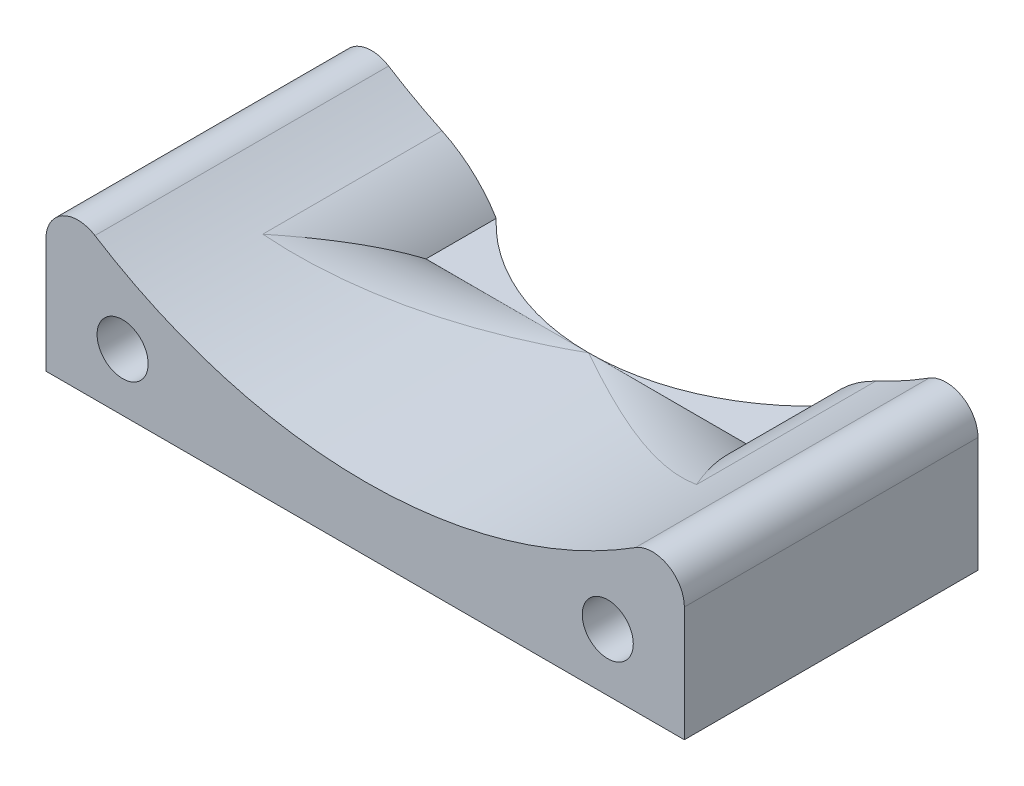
ISO-10303-21;
HEADER;
FILE_DESCRIPTION(('STEP AP214'),'2;1');
FILE_NAME('part.step','',(''),(''),'','','');
FILE_SCHEMA(('AUTOMOTIVE_DESIGN { 1 0 10303 214 1 1 1 1 }'));
ENDSEC;
DATA;
#1=APPLICATION_CONTEXT('core data for automotive mechanical design processes');
#2=APPLICATION_PROTOCOL_DEFINITION('international standard','automotive_design',2000,#1);
#3=PRODUCT_CONTEXT('',#1,'mechanical');
#4=PRODUCT('Part','Part','',(#3));
#5=PRODUCT_RELATED_PRODUCT_CATEGORY('part','',(#4));
#6=PRODUCT_DEFINITION_FORMATION('','',#4);
#7=PRODUCT_DEFINITION_CONTEXT('part definition',#1,'design');
#8=PRODUCT_DEFINITION('design','',#6,#7);
#9=PRODUCT_DEFINITION_SHAPE('','',#8);
#10=(LENGTH_UNIT() NAMED_UNIT(*) SI_UNIT(.MILLI.,.METRE.));
#11=(NAMED_UNIT(*) PLANE_ANGLE_UNIT() SI_UNIT($,.RADIAN.));
#12=(NAMED_UNIT(*) SI_UNIT($,.STERADIAN.) SOLID_ANGLE_UNIT());
#13=UNCERTAINTY_MEASURE_WITH_UNIT(LENGTH_MEASURE(1.E-05),#10,'distance_accuracy_value','');
#14=(GEOMETRIC_REPRESENTATION_CONTEXT(3) GLOBAL_UNCERTAINTY_ASSIGNED_CONTEXT((#13)) GLOBAL_UNIT_ASSIGNED_CONTEXT((#10,
#11,#12)) REPRESENTATION_CONTEXT('',''));
#15=CARTESIAN_POINT('',(0.,0.,0.));
#16=DIRECTION('',(0.,0.,1.));
#17=DIRECTION('',(1.,0.,0.));
#18=AXIS2_PLACEMENT_3D('',#15,#16,#17);
#19=CARTESIAN_POINT('',(0.,0.,0.));
#20=DIRECTION('',(0.,1.,0.));
#21=DIRECTION('',(0.,0.,1.));
#22=AXIS2_PLACEMENT_3D('',#19,#20,#21);
#23=PLANE('',#22);
#24=DIRECTION('',(-1.,0.,0.));
#25=VECTOR('',#24,1.);
#26=CARTESIAN_POINT('',(15.25,0.,44.));
#27=LINE('',#26,#25);
#28=CARTESIAN_POINT('',(15.25,0.,44.));
#29=VERTEX_POINT('',#28);
#30=CARTESIAN_POINT('',(-15.25,0.,44.));
#31=VERTEX_POINT('',#30);
#32=EDGE_CURVE('E160',#29,#31,#27,.T.);
#33=ORIENTED_EDGE('',*,*,#32,.F.);
#34=DIRECTION('',(0.,0.,-1.));
#35=VECTOR('',#34,1.);
#36=CARTESIAN_POINT('',(15.25,0.,44.));
#37=LINE('',#36,#35);
#38=CARTESIAN_POINT('',(15.25,0.,31.5029760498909));
#39=VERTEX_POINT('',#38);
#40=EDGE_CURVE('E145',#29,#39,#37,.T.);
#41=ORIENTED_EDGE('',*,*,#40,.T.);
#42=CARTESIAN_POINT('',(0.,0.,0.));
#43=DIRECTION('',(0.,1.,0.));
#44=DIRECTION('',(0.,0.,1.));
#45=AXIS2_PLACEMENT_3D('',#42,#43,#44);
#46=CIRCLE('',#45,35.);
#47=CARTESIAN_POINT('',(25.475478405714,0.,24.));
#48=VERTEX_POINT('',#47);
#49=EDGE_CURVE('E173',#39,#48,#46,.T.);
#50=ORIENTED_EDGE('',*,*,#49,.T.);
#51=DIRECTION('',(1.,0.,0.));
#52=VECTOR('',#51,1.);
#53=CARTESIAN_POINT('',(-50.,0.,24.));
#54=LINE('',#53,#52);
#55=CARTESIAN_POINT('',(50.,0.,24.));
#56=VERTEX_POINT('',#55);
#57=EDGE_CURVE('E207',#48,#56,#54,.T.);
#58=ORIENTED_EDGE('',*,*,#57,.T.);
#59=DIRECTION('',(0.,0.,-1.));
#60=VECTOR('',#59,1.);
#61=CARTESIAN_POINT('',(50.,0.,144.));
#62=LINE('',#61,#60);
#63=CARTESIAN_POINT('',(50.,0.,70.));
#64=VERTEX_POINT('',#63);
#65=EDGE_CURVE('E214',#64,#56,#62,.T.);
#66=ORIENTED_EDGE('',*,*,#65,.F.);
#67=DIRECTION('',(1.,0.,0.));
#68=VECTOR('',#67,1.);
#69=CARTESIAN_POINT('',(0.,0.,70.));
#70=LINE('',#69,#68);
#71=CARTESIAN_POINT('',(-50.,0.,70.));
#72=VERTEX_POINT('',#71);
#73=EDGE_CURVE('E183',#72,#64,#70,.T.);
#74=ORIENTED_EDGE('',*,*,#73,.F.);
#75=DIRECTION('',(0.,0.,-1.));
#76=VECTOR('',#75,1.);
#77=CARTESIAN_POINT('',(-50.,0.,144.));
#78=LINE('',#77,#76);
#79=CARTESIAN_POINT('',(-50.,0.,24.));
#80=VERTEX_POINT('',#79);
#81=EDGE_CURVE('E216',#72,#80,#78,.T.);
#82=ORIENTED_EDGE('',*,*,#81,.T.);
#83=CARTESIAN_POINT('',(-25.475478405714,0.,24.));
#84=VERTEX_POINT('',#83);
#85=EDGE_CURVE('E208',#80,#84,#54,.T.);
#86=ORIENTED_EDGE('',*,*,#85,.T.);
#87=CARTESIAN_POINT('',(-15.25,0.,31.5029760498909));
#88=VERTEX_POINT('',#87);
#89=EDGE_CURVE('E178',#84,#88,#46,.T.);
#90=ORIENTED_EDGE('',*,*,#89,.T.);
#91=DIRECTION('',(0.,0.,-1.));
#92=VECTOR('',#91,1.);
#93=CARTESIAN_POINT('',(-15.25,0.,44.));
#94=LINE('',#93,#92);
#95=EDGE_CURVE('E50',#31,#88,#94,.T.);
#96=ORIENTED_EDGE('',*,*,#95,.F.);
#97=EDGE_LOOP('',(#33,#41,#50,#58,#66,#74,#82,#86,#90,#96));
#98=FACE_BOUND('',#97,.T.);
#99=ADVANCED_FACE('F35',(#98),#23,.F.);
#100=CARTESIAN_POINT('',(-50.,24.,144.));
#101=DIRECTION('',(1.,0.,0.));
#102=DIRECTION('',(0.,0.,-1.));
#103=AXIS2_PLACEMENT_3D('',#100,#101,#102);
#104=PLANE('',#103);
#105=DIRECTION('',(0.,-1.,0.));
#106=VECTOR('',#105,1.);
#107=CARTESIAN_POINT('',(-50.,24.,70.));
#108=LINE('',#107,#106);
#109=CARTESIAN_POINT('',(-50.,18.0115182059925,70.));
#110=VERTEX_POINT('',#109);
#111=EDGE_CURVE('E181',#110,#72,#108,.T.);
#112=ORIENTED_EDGE('',*,*,#111,.F.);
#113=DIRECTION('',(0.,0.,1.));
#114=VECTOR('',#113,1.);
#115=CARTESIAN_POINT('',(-50.,18.0115182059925,134.437685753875));
#116=LINE('',#115,#114);
#117=CARTESIAN_POINT('',(-50.,18.0115182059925,24.));
#118=VERTEX_POINT('',#117);
#119=EDGE_CURVE('E324',#110,#118,#116,.F.);
#120=ORIENTED_EDGE('',*,*,#119,.T.);
#121=DIRECTION('',(0.,-1.,0.));
#122=VECTOR('',#121,1.);
#123=CARTESIAN_POINT('',(-50.,24.,24.));
#124=LINE('',#123,#122);
#125=EDGE_CURVE('E204',#118,#80,#124,.T.);
#126=ORIENTED_EDGE('',*,*,#125,.T.);
#127=ORIENTED_EDGE('',*,*,#81,.F.);
#128=EDGE_LOOP('',(#112,#120,#126,#127));
#129=FACE_BOUND('',#128,.T.);
#130=ADVANCED_FACE('F291',(#129),#104,.F.);
#131=CARTESIAN_POINT('',(50.,0.,144.));
#132=DIRECTION('',(-1.,0.,0.));
#133=DIRECTION('',(0.,0.,1.));
#134=AXIS2_PLACEMENT_3D('',#131,#132,#133);
#135=PLANE('',#134);
#136=DIRECTION('',(0.,1.,0.));
#137=VECTOR('',#136,1.);
#138=CARTESIAN_POINT('',(50.,0.,70.));
#139=LINE('',#138,#137);
#140=CARTESIAN_POINT('',(50.,18.0115182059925,70.));
#141=VERTEX_POINT('',#140);
#142=EDGE_CURVE('E188',#64,#141,#139,.T.);
#143=ORIENTED_EDGE('',*,*,#142,.F.);
#144=ORIENTED_EDGE('',*,*,#65,.T.);
#145=DIRECTION('',(0.,1.,0.));
#146=VECTOR('',#145,1.);
#147=CARTESIAN_POINT('',(50.,0.,24.));
#148=LINE('',#147,#146);
#149=CARTESIAN_POINT('',(50.,18.0115182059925,24.));
#150=VERTEX_POINT('',#149);
#151=EDGE_CURVE('E211',#56,#150,#148,.T.);
#152=ORIENTED_EDGE('',*,*,#151,.T.);
#153=DIRECTION('',(0.,0.,1.));
#154=VECTOR('',#153,1.);
#155=CARTESIAN_POINT('',(50.,18.0115182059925,144.));
#156=LINE('',#155,#154);
#157=EDGE_CURVE('E274',#150,#141,#156,.T.);
#158=ORIENTED_EDGE('',*,*,#157,.T.);
#159=EDGE_LOOP('',(#143,#144,#152,#158));
#160=FACE_BOUND('',#159,.T.);
#161=ADVANCED_FACE('F287',(#160),#135,.F.);
#162=CARTESIAN_POINT('',(0.,89.3214285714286,552.048566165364));
#163=DIRECTION('',(0.,0.,-1.));
#164=DIRECTION('',(-1.,0.,0.));
#165=AXIS2_PLACEMENT_3D('',#162,#163,#164);
#166=CYLINDRICAL_SURFACE('',#165,79.3214285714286);
#167=DIRECTION('',(0.,0.,-1.));
#168=VECTOR('',#167,1.);
#169=CARTESIAN_POINT('',(-42.3316391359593,22.2399754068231,552.048566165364));
#170=LINE('',#169,#168);
#171=CARTESIAN_POINT('',(-42.3316391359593,22.2399754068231,24.));
#172=VERTEX_POINT('',#171);
#173=CARTESIAN_POINT('',(-42.3316391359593,22.2399754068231,70.));
#174=VERTEX_POINT('',#173);
#175=EDGE_CURVE('E326',#172,#174,#170,.F.);
#176=ORIENTED_EDGE('',*,*,#175,.T.);
#177=CARTESIAN_POINT('',(0.,89.3214285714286,70.));
#178=DIRECTION('',(0.,0.,1.));
#179=DIRECTION('',(1.,0.,0.));
#180=AXIS2_PLACEMENT_3D('',#177,#178,#179);
#181=CIRCLE('',#180,79.3214285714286);
#182=CARTESIAN_POINT('',(42.3316391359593,22.2399754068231,70.));
#183=VERTEX_POINT('',#182);
#184=EDGE_CURVE('E58',#174,#183,#181,.T.);
#185=ORIENTED_EDGE('',*,*,#184,.T.);
#186=DIRECTION('',(0.,0.,-1.));
#187=VECTOR('',#186,1.);
#188=CARTESIAN_POINT('',(42.3316391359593,22.2399754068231,552.048566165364));
#189=LINE('',#188,#187);
#190=CARTESIAN_POINT('',(42.3316391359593,22.2399754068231,24.));
#191=VERTEX_POINT('',#190);
#192=EDGE_CURVE('E332',#183,#191,#189,.T.);
#193=ORIENTED_EDGE('',*,*,#192,.T.);
#194=CARTESIAN_POINT('',(0.,89.3214285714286,24.));
#195=DIRECTION('',(0.,0.,1.));
#196=DIRECTION('',(1.,0.,0.));
#197=AXIS2_PLACEMENT_3D('',#194,#195,#196);
#198=CIRCLE('',#197,79.3214285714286);
#199=CARTESIAN_POINT('',(33.9752981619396,17.6445972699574,24.));
#200=VERTEX_POINT('',#199);
#201=EDGE_CURVE('E202',#191,#200,#198,.F.);
#202=ORIENTED_EDGE('',*,*,#201,.T.);
#203=DIRECTION('',(0.,0.,-1.));
#204=VECTOR('',#203,1.);
#205=CARTESIAN_POINT('',(33.9752981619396,17.6445972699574,552.048566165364));
#206=LINE('',#205,#204);
#207=CARTESIAN_POINT('',(33.9752981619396,17.6445972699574,52.0663064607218));
#208=VERTEX_POINT('',#207);
#209=EDGE_CURVE('E397',#200,#208,#206,.F.);
#210=ORIENTED_EDGE('',*,*,#209,.T.);
#211=CARTESIAN_POINT('',(61.0464871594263,10.,35.));
#212=CARTESIAN_POINT('',(48.2618572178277,26.368501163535,34.2006123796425));
#213=CARTESIAN_POINT('',(48.7537748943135,26.7517996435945,54.9761921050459));
#214=CARTESIAN_POINT('',(60.4557428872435,10.,35.));
#215=CARTESIAN_POINT('',(48.0353933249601,26.1978562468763,34.5837244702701));
#216=CARTESIAN_POINT('',(48.2819866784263,26.3841669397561,54.9986285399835));
#217=CARTESIAN_POINT('',(59.8594825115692,10.,35.));
#218=CARTESIAN_POINT('',(47.7833521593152,26.0071606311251,34.9522262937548));
#219=CARTESIAN_POINT('',(47.8057931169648,26.021714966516,55.0048900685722));
#220=CARTESIAN_POINT('',(58.6573052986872,10.,35.));
#221=CARTESIAN_POINT('',(47.2364906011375,25.5963844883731,35.6507232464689));
#222=CARTESIAN_POINT('',(46.8456940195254,25.3079374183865,54.9876800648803));
#223=CARTESIAN_POINT('',(58.0513915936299,10.,35.));
#224=CARTESIAN_POINT('',(46.9423180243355,25.3767417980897,35.9815436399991));
#225=CARTESIAN_POINT('',(46.3617909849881,24.9566083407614,54.9642179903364));
#226=CARTESIAN_POINT('',(56.832036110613,10.,35.));
#227=CARTESIAN_POINT('',(46.3165219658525,24.9160861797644,36.6039691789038));
#228=CARTESIAN_POINT('',(45.3879727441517,24.266246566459,54.8902570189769));
#229=CARTESIAN_POINT('',(56.218610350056,10.,35.));
#230=CARTESIAN_POINT('',(45.9854628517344,24.6753750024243,36.8964155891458));
#231=CARTESIAN_POINT('',(44.8980703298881,23.9271923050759,54.8398082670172));
#232=CARTESIAN_POINT('',(54.9840879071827,10.,35.));
#233=CARTESIAN_POINT('',(45.2898453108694,24.1785420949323,37.4437740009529));
#234=CARTESIAN_POINT('',(43.9121392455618,23.2610993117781,54.7142085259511));
#235=CARTESIAN_POINT('',(54.3629905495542,10.,35.));
#236=CARTESIAN_POINT('',(44.9256408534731,23.9225403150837,37.699404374));
#237=CARTESIAN_POINT('',(43.416110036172,22.9340616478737,54.6390553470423));
#238=CARTESIAN_POINT('',(52.4988519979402,10.,35.));
#239=CARTESIAN_POINT('',(43.8024932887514,23.1490580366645,38.4031798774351));
#240=CARTESIAN_POINT('',(41.9273463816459,21.9762598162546,54.3810533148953));
#241=CARTESIAN_POINT('',(51.2456911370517,10.,35.));
#242=CARTESIAN_POINT('',(42.9929344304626,22.6110718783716,38.8071345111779));
#243=CARTESIAN_POINT('',(40.9265300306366,21.3635633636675,54.1650323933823));
#244=CARTESIAN_POINT('',(48.7174851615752,10.,35.));
#245=CARTESIAN_POINT('',(41.2814882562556,21.5272532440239,39.4846643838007));
#246=CARTESIAN_POINT('',(38.9074198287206,20.1877310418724,53.6584421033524));
#247=CARTESIAN_POINT('',(47.4424265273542,10.,35.));
#248=CARTESIAN_POINT('',(40.3801970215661,20.9805114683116,39.7622468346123));
#249=CARTESIAN_POINT('',(37.8891151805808,19.6246272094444,53.3678250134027));
#250=CARTESIAN_POINT('',(45.1834009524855,10.,35.));
#251=CARTESIAN_POINT('',(38.7261334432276,20.027930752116,40.1517369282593));
#252=CARTESIAN_POINT('',(36.0849814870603,18.6776930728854,52.8012892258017));
#253=CARTESIAN_POINT('',(44.2030141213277,10.,35.));
#254=CARTESIAN_POINT('',(37.9930923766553,19.6211021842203,40.2881576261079));
#255=CARTESIAN_POINT('',(35.302011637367,18.2832715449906,52.5385819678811));
#256=CARTESIAN_POINT('',(42.2337236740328,10.,35.));
#257=CARTESIAN_POINT('',(36.4923372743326,18.8218872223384,40.5028346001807));
#258=CARTESIAN_POINT('',(33.7292701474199,17.5231817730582,51.9814346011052));
#259=CARTESIAN_POINT('',(41.2448192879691,10.,35.));
#260=CARTESIAN_POINT('',(35.724309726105,18.4288060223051,40.58214827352));
#261=CARTESIAN_POINT('',(32.939497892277,17.1575161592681,51.6869915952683));
#262=CARTESIAN_POINT('',(39.2596908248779,10.,35.));
#263=CARTESIAN_POINT('',(34.1592756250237,17.6620434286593,40.6891992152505));
#264=CARTESIAN_POINT('',(31.3541076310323,16.4546945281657,51.0702870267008));
#265=CARTESIAN_POINT('',(38.2634657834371,10.,35.));
#266=CARTESIAN_POINT('',(33.3617952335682,17.2876421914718,40.7177463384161));
#267=CARTESIAN_POINT('',(30.5584888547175,16.1175423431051,50.7480217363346));
#268=CARTESIAN_POINT('',(36.2648139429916,10.,35.));
#269=CARTESIAN_POINT('',(31.7426698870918,16.5618687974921,40.7293967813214));
#270=CARTESIAN_POINT('',(28.9622983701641,15.4714742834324,50.0791372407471));
#271=CARTESIAN_POINT('',(35.26238654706,10.,35.));
#272=CARTESIAN_POINT('',(30.920434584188,16.2097868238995,40.7131041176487));
#273=CARTESIAN_POINT('',(28.1617261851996,15.1625611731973,49.7325156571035));
#274=CARTESIAN_POINT('',(32.2392738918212,10.,35.));
#275=CARTESIAN_POINT('',(28.4319458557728,15.1957969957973,40.6047376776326));
#276=CARTESIAN_POINT('',(25.7473668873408,14.2753750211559,48.6579993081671));
#277=CARTESIAN_POINT('',(30.2103656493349,10.,35.));
#278=CARTESIAN_POINT('',(26.7157133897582,14.5628007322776,40.4540717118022));
#279=CARTESIAN_POINT('',(24.1270126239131,13.7393394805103,47.8978602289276));
#280=CARTESIAN_POINT('',(26.1377735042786,10.,35.));
#281=CARTESIAN_POINT('',(23.230901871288,13.4176638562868,40.0307131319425));
#282=CARTESIAN_POINT('',(20.8745037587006,12.777189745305,46.3134763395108));
#283=CARTESIAN_POINT('',(24.0940924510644,10.,35.));
#284=CARTESIAN_POINT('',(21.455982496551,12.9008222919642,39.759443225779));
#285=CARTESIAN_POINT('',(19.2423514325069,12.3510549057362,45.4892436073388));
#286=CARTESIAN_POINT('',(20.4894260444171,10.,35.));
#287=CARTESIAN_POINT('',(18.2981156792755,12.1017414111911,39.2038955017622));
#288=CARTESIAN_POINT('',(16.3635437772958,11.6957477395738,43.9979586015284));
#289=CARTESIAN_POINT('',(18.9307295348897,9.99999999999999,35.));
#290=CARTESIAN_POINT('',(16.9244336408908,11.7921596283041,38.9392168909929));
#291=CARTESIAN_POINT('',(15.1187163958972,11.4438564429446,43.3408596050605));
#292=CARTESIAN_POINT('',(15.8085624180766,9.99999999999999,35.));
#293=CARTESIAN_POINT('',(14.1626585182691,11.2466959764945,38.371877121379));
#294=CARTESIAN_POINT('',(12.6252488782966,11.0009580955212,42.0060786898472));
#295=CARTESIAN_POINT('',(14.2450911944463,9.99999999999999,35.));
#296=CARTESIAN_POINT('',(12.7714956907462,11.0095724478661,38.0688760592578));
#297=CARTESIAN_POINT('',(11.376608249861,10.8099592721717,41.3283940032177));
#298=CARTESIAN_POINT('',(9.55642863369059,9.99999999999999,35.));
#299=CARTESIAN_POINT('',(8.60321366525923,10.4133053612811,37.1242213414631));
#300=CARTESIAN_POINT('',(7.63208485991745,10.3279805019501,39.2764888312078));
#301=CARTESIAN_POINT('',(6.42526480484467,9.99999999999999,35.));
#302=CARTESIAN_POINT('',(5.78065336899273,10.1587676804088,36.4364854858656));
#303=CARTESIAN_POINT('',(5.1314322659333,10.1266244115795,37.8801666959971));
#304=CARTESIAN_POINT('',(2.7549355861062,9.99999999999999,35.));
#305=CARTESIAN_POINT('',(2.47741244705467,10.0367264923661,35.6173341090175));
#306=CARTESIAN_POINT('',(2.20018408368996,10.0293486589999,36.235834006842));
#307=CARTESIAN_POINT('',(2.21549314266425,9.99999999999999,35.));
#308=CARTESIAN_POINT('',(1.99235541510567,10.0232403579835,35.4966871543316));
#309=CARTESIAN_POINT('',(1.76936723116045,10.01856575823,35.9939682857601));
#310=CARTESIAN_POINT('',(1.13653087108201,9.99999999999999,35.));
#311=CARTESIAN_POINT('',(1.02216535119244,10.005044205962,35.2550116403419));
#312=CARTESIAN_POINT('',(0.907671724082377,10.0040228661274,35.5100022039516));
#313=CARTESIAN_POINT('',(0.597011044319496,9.99999999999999,35.));
#314=CARTESIAN_POINT('',(0.536904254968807,10.0003292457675,35.1339512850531));
#315=CARTESIAN_POINT('',(0.476793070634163,10.0002627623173,35.2679018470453));
#316=CARTESIAN_POINT('',(0.0383373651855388,9.99999999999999,35.));
#317=CARTESIAN_POINT('',(0.034477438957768,10.0000055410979,35.0086017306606));
#318=CARTESIAN_POINT('',(0.0306175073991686,10.0000044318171,35.0172034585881));
#319=CARTESIAN_POINT('',(0.0191686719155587,9.99999999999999,35.));
#320=CARTESIAN_POINT('',(0.0172387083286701,9.9999999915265,35.0043008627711));
#321=CARTESIAN_POINT('',(0.0153087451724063,10.0000000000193,35.0086017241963));
#322=CARTESIAN_POINT('',(0.,9.99999999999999,35.));
#323=CARTESIAN_POINT('',(0.,10.,35.));
#324=CARTESIAN_POINT('',(0.,10.,35.));
#325=(BOUNDED_SURFACE() B_SPLINE_SURFACE(3,2,((#211,#212,#213),(#214,#215,#216),(#217,#218,
#219),(#220,#221,#222),(#223,#224,#225),(#226,#227,#228),(#229,#230,#231),(#232,#233,#234),
(#235,#236,#237),(#238,#239,#240),(#241,#242,#243),(#244,#245,#246),(#247,#248,#249),(#250,#251,
#252),(#253,#254,#255),(#256,#257,#258),(#259,#260,#261),(#262,#263,#264),(#265,#266,#267),
(#268,#269,#270),(#271,#272,#273),(#274,#275,#276),(#277,#278,#279),(#280,#281,#282),(#283,#284,
#285),(#286,#287,#288),(#289,#290,#291),(#292,#293,#294),(#295,#296,#297),(#298,#299,#300),
(#301,#302,#303),(#304,#305,#306),(#307,#308,#309),(#310,#311,#312),(#313,#314,#315),(#316,#317,
#318),(#319,#320,#321),(#322,#323,#324)),.UNSPECIFIED.,.F.,.F.,
.F.) B_SPLINE_SURFACE_WITH_KNOTS((4,2,2,2,2,2,2,2,2,2,2,2,2,2,2,2,2,2,4),(3,3),(0.,
2.24736525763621,4.49401560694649,6.73650580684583,8.97919483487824,13.4305255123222,
17.8847109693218,21.269909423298,24.6554171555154,28.0413791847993,31.4276723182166,
38.2261683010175,45.0233862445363,50.183565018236,55.3444407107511,65.6405989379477,
67.4146289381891,69.1886305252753,69.251661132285),(0.,1.),
.UNSPECIFIED.) GEOMETRIC_REPRESENTATION_ITEM() RATIONAL_B_SPLINE_SURFACE(((1.,0.69336957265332,
1.),(1.,0.699834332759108,1.),(1.,0.706232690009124,1.),(1.,0.71887577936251,1.),(1.,
0.725120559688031,1.),(1.,0.737428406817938,1.),(1.,0.743491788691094,1.),(1.,0.755435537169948,
1.),(1.,0.761315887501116,1.),(1.,0.778578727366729,1.),(1.,0.78967666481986,1.),(1.,
0.81105377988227,1.),(1.,0.82133242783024,1.),(1.,0.83866921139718,1.),(1.,0.845908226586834,
1.),(1.,0.859886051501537,1.),(1.,0.866624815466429,1.),(1.,0.879598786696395,1.),(1.,
0.88583392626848,1.),(1.,0.897799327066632,1.),(1.,0.903529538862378,1.),(1.,0.920006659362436,
1.),(1.,0.929990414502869,1.),(1.,0.947940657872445,1.),(1.,0.955907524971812,1.),(1.,
0.968173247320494,1.),(1.,0.972893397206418,1.),(1.,0.981198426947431,1.),(1.,0.984783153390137,
1.),(1.,0.993832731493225,1.),(1.,0.997619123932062,1.),(1.,0.999448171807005,1.),(1.,
0.999650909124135,1.),(1.,0.999924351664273,1.),(1.,0.999995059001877,1.),(1.,0.999999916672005,
1.),(1.,1.0000000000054,1.),(1.,1.,1.))) REPRESENTATION_ITEM('') SURFACE());
#326=CARTESIAN_POINT('',(48.7537748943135,26.7517996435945,54.9761921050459));
#327=CARTESIAN_POINT('',(48.2819866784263,26.3841669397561,54.9986285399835));
#328=CARTESIAN_POINT('',(47.8057931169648,26.021714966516,55.0048900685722));
#329=CARTESIAN_POINT('',(46.8456940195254,25.3079374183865,54.9876800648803));
#330=CARTESIAN_POINT('',(46.3617909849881,24.9566083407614,54.9642179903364));
#331=CARTESIAN_POINT('',(45.3879727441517,24.266246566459,54.8902570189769));
#332=CARTESIAN_POINT('',(44.8980703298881,23.9271923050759,54.8398082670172));
#333=CARTESIAN_POINT('',(43.9121392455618,23.2610993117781,54.7142085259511));
#334=CARTESIAN_POINT('',(43.416110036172,22.9340616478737,54.6390553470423));
#335=CARTESIAN_POINT('',(41.9273463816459,21.9762598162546,54.3810533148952));
#336=CARTESIAN_POINT('',(40.9265300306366,21.3635633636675,54.1650323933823));
#337=CARTESIAN_POINT('',(38.9074198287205,20.1877310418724,53.6584421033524));
#338=CARTESIAN_POINT('',(37.8891151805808,19.6246272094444,53.3678250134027));
#339=CARTESIAN_POINT('',(36.0849814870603,18.6776930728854,52.8012892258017));
#340=CARTESIAN_POINT('',(35.302011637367,18.2832715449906,52.5385819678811));
#341=CARTESIAN_POINT('',(33.7292701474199,17.5231817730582,51.9814346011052));
#342=CARTESIAN_POINT('',(32.939497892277,17.1575161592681,51.6869915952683));
#343=CARTESIAN_POINT('',(31.3541076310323,16.4546945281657,51.0702870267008));
#344=CARTESIAN_POINT('',(30.5584888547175,16.1175423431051,50.7480217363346));
#345=CARTESIAN_POINT('',(28.9622983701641,15.4714742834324,50.0791372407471));
#346=CARTESIAN_POINT('',(28.1617261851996,15.1625611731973,49.7325156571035));
#347=CARTESIAN_POINT('',(25.7473668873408,14.2753750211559,48.6579993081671));
#348=CARTESIAN_POINT('',(24.1270126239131,13.7393394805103,47.8978602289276));
#349=CARTESIAN_POINT('',(20.8745037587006,12.777189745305,46.3134763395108));
#350=CARTESIAN_POINT('',(19.2423514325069,12.3510549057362,45.4892436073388));
#351=CARTESIAN_POINT('',(16.3635437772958,11.6957477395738,43.9979586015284));
#352=CARTESIAN_POINT('',(15.1187163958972,11.4438564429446,43.3408596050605));
#353=CARTESIAN_POINT('',(12.6252488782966,11.0009580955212,42.0060786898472));
#354=CARTESIAN_POINT('',(11.376608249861,10.8099592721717,41.3283940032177));
#355=CARTESIAN_POINT('',(7.63208485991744,10.3279805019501,39.2764888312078));
#356=CARTESIAN_POINT('',(5.13143226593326,10.1266244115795,37.880166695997));
#357=CARTESIAN_POINT('',(2.20018408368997,10.0293486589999,36.235834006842));
#358=CARTESIAN_POINT('',(1.76936723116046,10.01856575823,35.9939682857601));
#359=CARTESIAN_POINT('',(0.907671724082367,10.0040228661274,35.5100022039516));
#360=CARTESIAN_POINT('',(0.476793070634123,10.0002627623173,35.2679018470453));
#361=CARTESIAN_POINT('',(0.0306175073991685,10.0000044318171,35.0172034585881));
#362=CARTESIAN_POINT('',(0.0153087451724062,10.0000000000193,35.0086017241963));
#363=CARTESIAN_POINT('',(0.,10.,35.));
#364=B_SPLINE_CURVE_WITH_KNOTS('',3,(#326,#327,#328,#329,#330,#331,#332,#333,#334,#335,#336,
#337,#338,#339,#340,#341,#342,#343,#344,#345,#346,#347,#348,#349,#350,#351,#352,#353,#354,#355,
#356,#357,#358,#359,#360,#361,#362,#363),.UNSPECIFIED.,.F.,.F.,(4,2,2,2,2,2,2,2,2,2,2,2,2,2,2,2,
2,2,4),(0.,2.24736525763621,4.49401560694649,6.73650580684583,8.97919483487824,13.4305255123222,
17.8847109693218,21.269909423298,24.6554171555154,28.0413791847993,31.4276723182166,
38.2261683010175,45.0233862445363,50.183565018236,55.3444407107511,65.6405989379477,
67.4146289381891,69.1886305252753,69.251661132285),.UNSPECIFIED.);
#365=CARTESIAN_POINT('',(0.,10.,35.));
#366=VERTEX_POINT('',#365);
#367=EDGE_CURVE('E412',#208,#366,#364,.T.);
#368=ORIENTED_EDGE('',*,*,#367,.T.);
#369=CARTESIAN_POINT('',(0.,9.99999999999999,35.));
#370=CARTESIAN_POINT('',(0.,10.,35.));
#371=CARTESIAN_POINT('',(0.,10.,35.));
#372=CARTESIAN_POINT('',(-0.0095842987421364,9.99999999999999,35.));
#373=CARTESIAN_POINT('',(-0.00861932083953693,10.0000000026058,35.0021504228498));
#374=CARTESIAN_POINT('',(-0.0076543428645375,9.99999999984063,35.0043008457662));
#375=CARTESIAN_POINT('',(-0.0191685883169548,9.99999999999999,35.));
#376=CARTESIAN_POINT('',(-0.0172386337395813,10.0000013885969,35.0043008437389));
#377=CARTESIAN_POINT('',(-0.0153086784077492,10.0000011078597,35.0086016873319));
#378=CARTESIAN_POINT('',(-0.0383372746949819,9.99999999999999,35.));
#379=CARTESIAN_POINT('',(-0.0344773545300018,10.0000069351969,35.0086017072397));
#380=CARTESIAN_POINT('',(-0.0306174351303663,10.0000055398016,35.0172034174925));
#381=CARTESIAN_POINT('',(-0.0479216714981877,9.99999999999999,35.));
#382=CARTESIAN_POINT('',(-0.0430967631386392,10.0000110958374,35.0107521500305));
#383=CARTESIAN_POINT('',(-0.0382718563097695,10.0000088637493,35.0215043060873));
#384=CARTESIAN_POINT('',(-1.89403333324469,9.99999999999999,35.));
#385=CARTESIAN_POINT('',(-1.7033620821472,10.0010804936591,35.4249687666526));
#386=CARTESIAN_POINT('',(-1.51263863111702,10.0008624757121,35.8499256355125));
#387=CARTESIAN_POINT('',(-3.73088757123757,9.99999999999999,35.));
#388=CARTESIAN_POINT('',(-3.35777991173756,10.0532683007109,35.8376531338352));
#389=CARTESIAN_POINT('',(-2.9796121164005,10.0423837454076,36.6741560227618));
#390=CARTESIAN_POINT('',(-7.40289593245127,9.99999999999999,35.));
#391=CARTESIAN_POINT('',(-6.65485755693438,10.2590698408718,36.6460449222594));
#392=CARTESIAN_POINT('',(-5.91220131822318,10.2070020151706,38.3142039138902));
#393=CARTESIAN_POINT('',(-9.23804961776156,9.99999999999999,35.));
#394=CARTESIAN_POINT('',(-8.30256262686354,10.4133382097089,37.0429424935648));
#395=CARTESIAN_POINT('',(-7.37781668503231,10.330116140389,39.1300196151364));
#396=CARTESIAN_POINT('',(-12.9053723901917,9.99999999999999,35.));
#397=CARTESIAN_POINT('',(-11.5795816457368,10.8220647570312,37.8037960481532));
#398=CARTESIAN_POINT('',(-10.3066638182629,10.6586409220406,40.7448009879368));
#399=CARTESIAN_POINT('',(-14.7375395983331,9.99999999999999,35.));
#400=CARTESIAN_POINT('',(-13.2138993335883,11.0778402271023,38.1687198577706));
#401=CARTESIAN_POINT('',(-11.7698940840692,10.864091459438,41.5437582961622));
#402=CARTESIAN_POINT('',(-18.3962985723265,9.99999999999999,35.));
#403=CARTESIAN_POINT('',(-16.4555405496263,11.6875864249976,38.8482085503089));
#404=CARTESIAN_POINT('',(-14.6919018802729,11.3584042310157,43.1152131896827));
#405=CARTESIAN_POINT('',(-20.222888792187,9.99999999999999,35.));
#406=CARTESIAN_POINT('',(-18.0677970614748,12.0435000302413,39.1633681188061));
#407=CARTESIAN_POINT('',(-16.1506781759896,11.6472877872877,43.8877039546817));
#408=CARTESIAN_POINT('',(-23.2673769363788,9.99999999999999,35.));
#409=CARTESIAN_POINT('',(-20.724593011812,12.7157214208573,39.6307793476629));
#410=CARTESIAN_POINT('',(-18.5821086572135,12.2007662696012,45.1472138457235));
#411=CARTESIAN_POINT('',(-24.4877331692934,9.99999999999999,35.));
#412=CARTESIAN_POINT('',(-21.7868934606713,13.0084124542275,39.8031859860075));
#413=CARTESIAN_POINT('',(-19.5567261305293,12.4420580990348,45.644504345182));
#414=CARTESIAN_POINT('',(-26.9236935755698,9.99999999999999,35.));
#415=CARTESIAN_POINT('',(-23.8918529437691,13.6351493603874,40.1102325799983));
#416=CARTESIAN_POINT('',(-21.5021659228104,12.9633248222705,46.6187700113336));
#417=CARTESIAN_POINT('',(-28.1392976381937,9.99999999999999,35.));
#418=CARTESIAN_POINT('',(-24.9359051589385,13.9701006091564,40.2447130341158));
#419=CARTESIAN_POINT('',(-22.4729881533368,13.2433006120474,47.0957447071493));
#420=CARTESIAN_POINT('',(-30.5640945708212,9.99999999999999,35.));
#421=CARTESIAN_POINT('',(-26.9996068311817,14.6790624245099,40.4687030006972));
#422=CARTESIAN_POINT('',(-24.4095124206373,13.8423486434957,48.0251834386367));
#423=CARTESIAN_POINT('',(-31.7732901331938,9.99999999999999,35.));
#424=CARTESIAN_POINT('',(-28.0205887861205,15.0540829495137,40.5578645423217));
#425=CARTESIAN_POINT('',(-25.3752166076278,14.1614028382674,48.4776586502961));
#426=CARTESIAN_POINT('',(-34.1845791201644,9.99999999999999,35.));
#427=CARTESIAN_POINT('',(-30.0335614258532,15.8402696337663,40.6834209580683));
#428=CARTESIAN_POINT('',(-27.300952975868,14.8392901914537,49.3538658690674));
#429=CARTESIAN_POINT('',(-35.3866728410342,9.99999999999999,35.));
#430=CARTESIAN_POINT('',(-31.026758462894,16.2525675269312,40.7191819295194));
#431=CARTESIAN_POINT('',(-28.2609853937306,15.1981216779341,49.777599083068));
#432=CARTESIAN_POINT('',(-37.7897360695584,9.99999999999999,35.));
#433=CARTESIAN_POINT('',(-32.9841586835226,17.1117258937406,40.7292273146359));
#434=CARTESIAN_POINT('',(-30.1801523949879,15.9585002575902,50.5937732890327));
#435=CARTESIAN_POINT('',(-38.9906532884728,9.99999999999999,35.));
#436=CARTESIAN_POINT('',(-33.9491112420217,17.559972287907,40.7021447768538));
#437=CARTESIAN_POINT('',(-31.1392452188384,16.3602962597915,50.9860060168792));
#438=CARTESIAN_POINT('',(-41.3819122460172,9.99999999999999,35.));
#439=CARTESIAN_POINT('',(-35.835638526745,18.4824871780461,40.5759105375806));
#440=CARTESIAN_POINT('',(-33.0489849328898,17.2052462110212,51.7302446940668));
#441=CARTESIAN_POINT('',(-42.5722556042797,9.99999999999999,35.));
#442=CARTESIAN_POINT('',(-36.7580463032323,18.9580145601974,40.4753515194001));
#443=CARTESIAN_POINT('',(-33.9996331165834,17.6483937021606,52.082256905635));
#444=CARTESIAN_POINT('',(-44.9432793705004,9.99999999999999,35.));
#445=CARTESIAN_POINT('',(-38.5523175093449,19.9276490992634,40.191100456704));
#446=CARTESIAN_POINT('',(-35.8932123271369,18.5776586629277,52.7400068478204));
#447=CARTESIAN_POINT('',(-46.1239303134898,9.99999999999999,35.));
#448=CARTESIAN_POINT('',(-39.4245011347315,20.422984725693,40.0052617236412));
#449=CARTESIAN_POINT('',(-36.8361198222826,19.0638751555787,53.0456333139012));
#450=CARTESIAN_POINT('',(-47.8835793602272,9.99999999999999,35.));
#451=CARTESIAN_POINT('',(-40.6769952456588,21.1655545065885,39.6575908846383));
#452=CARTESIAN_POINT('',(-38.2414346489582,19.824911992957,53.4624859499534));
#453=CARTESIAN_POINT('',(-48.4684254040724,9.99999999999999,35.));
#454=CARTESIAN_POINT('',(-41.0888451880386,21.4153602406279,39.528707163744));
#455=CARTESIAN_POINT('',(-38.7085123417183,20.0839637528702,53.5945410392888));
#456=CARTESIAN_POINT('',(-49.6339121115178,9.99999999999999,35.));
#457=CARTESIAN_POINT('',(-41.8944870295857,21.9142470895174,39.2455790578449));
#458=CARTESIAN_POINT('',(-39.6393091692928,20.6126176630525,53.8435744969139));
#459=CARTESIAN_POINT('',(-50.2145523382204,9.99999999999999,35.));
#460=CARTESIAN_POINT('',(-42.2882352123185,22.1634283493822,39.0909643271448));
#461=CARTESIAN_POINT('',(-40.1030279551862,20.8822208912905,53.9605513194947));
#462=CARTESIAN_POINT('',(-50.7928796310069,9.99999999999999,35.));
#463=CARTESIAN_POINT('',(-42.66952162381,22.4095531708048,38.9239285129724));
#464=CARTESIAN_POINT('',(-40.5648995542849,21.157083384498,54.069391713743));
#465=(BOUNDED_SURFACE() B_SPLINE_SURFACE(3,2,((#369,#370,#371),(#372,#373,#374),(#375,#376,
#377),(#378,#379,#380),(#381,#382,#383),(#384,#385,#386),(#387,#388,#389),(#390,#391,#392),
(#393,#394,#395),(#396,#397,#398),(#399,#400,#401),(#402,#403,#404),(#405,#406,#407),(#408,#409,
#410),(#411,#412,#413),(#414,#415,#416),(#417,#418,#419),(#420,#421,#422),(#423,#424,#425),
(#426,#427,#428),(#429,#430,#431),(#432,#433,#434),(#435,#436,#437),(#438,#439,#440),(#441,#442,
#443),(#444,#445,#446),(#447,#448,#449),(#450,#451,#452),(#453,#454,#455),(#456,#457,#458),
(#459,#460,#461),(#462,#463,#464)),.UNSPECIFIED.,.F.,.F.,.F.) B_SPLINE_SURFACE_WITH_KNOTS((4,2,
2,2,2,2,2,2,2,2,2,2,2,2,2,4),(3,3),(0.,0.0315151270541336,0.0630306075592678,6.1019067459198,
12.1420507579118,18.1851239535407,24.229742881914,28.2847705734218,32.339892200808,
36.393148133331,40.4462337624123,44.5242225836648,48.6015756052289,52.6885593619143,
54.7333526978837,56.778355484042),(0.,1.),
.UNSPECIFIED.) GEOMETRIC_REPRESENTATION_ITEM() RATIONAL_B_SPLINE_SURFACE(((1.,1.,1.),(1.,
1.00000000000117,1.),(1.,0.999999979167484,1.),(1.,0.999999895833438,1.),(1.,0.999999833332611,
1.),(1.,0.999983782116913,1.),(1.,0.999202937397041,1.),(1.,0.996108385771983,1.),(1.,
0.99379435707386,1.),(1.,0.98762371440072,1.),(1.,0.983766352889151,1.),(1.,0.974494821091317,
1.),(1.,0.969080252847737,1.),(1.,0.9587205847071,1.),(1.,0.954207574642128,1.),(1.,
0.944468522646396,1.),(1.,0.939242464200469,1.),(1.,0.928074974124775,1.),(1.,0.922133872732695,
1.),(1.,0.909530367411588,1.),(1.,0.902867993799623,1.),(1.,0.888776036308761,1.),(1.,
0.881341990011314,1.),(1.,0.865743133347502,1.),(1.,0.85757843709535,1.),(1.,0.840502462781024,
1.),(1.,0.831589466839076,1.),(1.,0.817683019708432,1.),(1.,0.812956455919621,1.),(1.,
0.803327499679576,1.),(1.,0.798425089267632,1.),(1.,0.793436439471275,1.))) REPRESENTATION_ITEM('') SURFACE());
#466=CARTESIAN_POINT('',(-40.5648995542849,21.157083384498,54.069391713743));
#467=CARTESIAN_POINT('',(-40.1030279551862,20.8822208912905,53.9605513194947));
#468=CARTESIAN_POINT('',(-39.6393091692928,20.6126176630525,53.8435744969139));
#469=CARTESIAN_POINT('',(-38.7085123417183,20.0839637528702,53.5945410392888));
#470=CARTESIAN_POINT('',(-38.2414346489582,19.824911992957,53.4624859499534));
#471=CARTESIAN_POINT('',(-36.8361198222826,19.0638751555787,53.0456333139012));
#472=CARTESIAN_POINT('',(-35.8932123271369,18.5776586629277,52.7400068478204));
#473=CARTESIAN_POINT('',(-33.9996331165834,17.6483937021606,52.082256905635));
#474=CARTESIAN_POINT('',(-33.0489849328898,17.2052462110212,51.7302446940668));
#475=CARTESIAN_POINT('',(-31.1392452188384,16.3602962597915,50.9860060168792));
#476=CARTESIAN_POINT('',(-30.1801523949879,15.9585002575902,50.5937732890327));
#477=CARTESIAN_POINT('',(-28.2609853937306,15.1981216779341,49.777599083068));
#478=CARTESIAN_POINT('',(-27.300952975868,14.8392901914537,49.3538658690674));
#479=CARTESIAN_POINT('',(-25.3752166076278,14.1614028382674,48.4776586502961));
#480=CARTESIAN_POINT('',(-24.4095124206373,13.8423486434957,48.0251834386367));
#481=CARTESIAN_POINT('',(-22.4729881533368,13.2433006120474,47.0957447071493));
#482=CARTESIAN_POINT('',(-21.5021659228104,12.9633248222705,46.6187700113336));
#483=CARTESIAN_POINT('',(-19.5567261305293,12.4420580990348,45.644504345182));
#484=CARTESIAN_POINT('',(-18.5821086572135,12.2007662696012,45.1472138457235));
#485=CARTESIAN_POINT('',(-16.1506781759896,11.6472877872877,43.8877039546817));
#486=CARTESIAN_POINT('',(-14.6919018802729,11.3584042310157,43.1152131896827));
#487=CARTESIAN_POINT('',(-11.7698940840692,10.864091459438,41.5437582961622));
#488=CARTESIAN_POINT('',(-10.306663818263,10.6586409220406,40.7448009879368));
#489=CARTESIAN_POINT('',(-7.3778166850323,10.330116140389,39.1300196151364));
#490=CARTESIAN_POINT('',(-5.91220131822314,10.2070020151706,38.3142039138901));
#491=CARTESIAN_POINT('',(-2.97961211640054,10.0423837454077,36.6741560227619));
#492=CARTESIAN_POINT('',(-1.51263863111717,10.0008624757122,35.8499256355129));
#493=CARTESIAN_POINT('',(-0.0382718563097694,10.0000088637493,35.0215043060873));
#494=CARTESIAN_POINT('',(-0.0306174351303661,10.0000055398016,35.0172034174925));
#495=CARTESIAN_POINT('',(-0.0153086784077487,10.0000011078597,35.0086016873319));
#496=CARTESIAN_POINT('',(-0.00765434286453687,9.99999999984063,35.0043008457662));
#497=CARTESIAN_POINT('',(0.,10.,35.));
#498=B_SPLINE_CURVE_WITH_KNOTS('',3,(#466,#467,#468,#469,#470,#471,#472,#473,#474,#475,#476,
#477,#478,#479,#480,#481,#482,#483,#484,#485,#486,#487,#488,#489,#490,#491,#492,#493,#494,#495,
#496,#497),.UNSPECIFIED.,.F.,.F.,(4,2,2,2,2,2,2,2,2,2,2,2,2,2,2,4),(0.,2.0450027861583,
4.08979612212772,8.17677987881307,12.2541329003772,16.3321217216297,20.3852073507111,
24.438463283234,28.4935849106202,32.548612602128,38.5932315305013,44.6363047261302,
50.6764487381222,56.7153248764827,56.7468403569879,56.778355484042),.UNSPECIFIED.);
#499=CARTESIAN_POINT('',(-33.9752981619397,17.6445972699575,52.0663064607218));
#500=VERTEX_POINT('',#499);
#501=EDGE_CURVE('E229',#366,#500,#498,.F.);
#502=ORIENTED_EDGE('',*,*,#501,.T.);
#503=DIRECTION('',(0.,0.,-1.));
#504=VECTOR('',#503,1.);
#505=CARTESIAN_POINT('',(-33.9752981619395,17.6445972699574,552.048566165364));
#506=LINE('',#505,#504);
#507=CARTESIAN_POINT('',(-33.9752981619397,17.6445972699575,24.));
#508=VERTEX_POINT('',#507);
#509=EDGE_CURVE('E236',#500,#508,#506,.T.);
#510=ORIENTED_EDGE('',*,*,#509,.T.);
#511=EDGE_CURVE('E201',#508,#172,#198,.F.);
#512=ORIENTED_EDGE('',*,*,#511,.T.);
#513=EDGE_LOOP('',(#176,#185,#193,#202,#210,#368,#502,#510,#512));
#514=FACE_BOUND('',#513,.T.);
#515=ADVANCED_FACE('F238',(#514),#166,.F.);
#516=CARTESIAN_POINT('',(45.,18.0115182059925,552.048566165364));
#517=DIRECTION('',(0.,0.,-1.));
#518=DIRECTION('',(-1.,0.,0.));
#519=AXIS2_PLACEMENT_3D('',#516,#517,#518);
#520=CYLINDRICAL_SURFACE('',#519,5.);
#521=ORIENTED_EDGE('',*,*,#192,.F.);
#522=CARTESIAN_POINT('',(45.,18.0115182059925,70.));
#523=DIRECTION('',(0.,0.,1.));
#524=DIRECTION('',(1.,0.,0.));
#525=AXIS2_PLACEMENT_3D('',#522,#523,#524);
#526=CIRCLE('',#525,5.);
#527=EDGE_CURVE('E185',#183,#141,#526,.F.);
#528=ORIENTED_EDGE('',*,*,#527,.T.);
#529=ORIENTED_EDGE('',*,*,#157,.F.);
#530=CARTESIAN_POINT('',(45.,18.0115182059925,24.));
#531=DIRECTION('',(0.,0.,1.));
#532=DIRECTION('',(1.,0.,0.));
#533=AXIS2_PLACEMENT_3D('',#530,#531,#532);
#534=CIRCLE('',#533,5.);
#535=EDGE_CURVE('E328',#191,#150,#534,.F.);
#536=ORIENTED_EDGE('',*,*,#535,.F.);
#537=EDGE_LOOP('',(#521,#528,#529,#536));
#538=FACE_BOUND('',#537,.T.);
#539=ADVANCED_FACE('F278',(#538),#520,.T.);
#540=CARTESIAN_POINT('',(-45.,18.0115182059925,552.048566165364));
#541=DIRECTION('',(0.,0.,-1.));
#542=DIRECTION('',(-1.,0.,0.));
#543=AXIS2_PLACEMENT_3D('',#540,#541,#542);
#544=CYLINDRICAL_SURFACE('',#543,5.);
#545=ORIENTED_EDGE('',*,*,#119,.F.);
#546=CARTESIAN_POINT('',(-45.,18.0115182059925,70.));
#547=DIRECTION('',(0.,0.,1.));
#548=DIRECTION('',(1.,0.,0.));
#549=AXIS2_PLACEMENT_3D('',#546,#547,#548);
#550=CIRCLE('',#549,5.);
#551=EDGE_CURVE('E327',#110,#174,#550,.F.);
#552=ORIENTED_EDGE('',*,*,#551,.T.);
#553=ORIENTED_EDGE('',*,*,#175,.F.);
#554=CARTESIAN_POINT('',(-45.,18.0115182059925,24.));
#555=DIRECTION('',(0.,0.,1.));
#556=DIRECTION('',(1.,0.,0.));
#557=AXIS2_PLACEMENT_3D('',#554,#555,#556);
#558=CIRCLE('',#557,5.);
#559=EDGE_CURVE('E318',#118,#172,#558,.F.);
#560=ORIENTED_EDGE('',*,*,#559,.F.);
#561=EDGE_LOOP('',(#545,#552,#553,#560));
#562=FACE_BOUND('',#561,.T.);
#563=ADVANCED_FACE('F37',(#562),#544,.T.);
#564=CARTESIAN_POINT('',(0.,1.99999999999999,0.));
#565=DIRECTION('',(0.,1.,0.));
#566=DIRECTION('',(-1.,0.,0.));
#567=AXIS2_PLACEMENT_3D('',#564,#565,#566);
#568=CYLINDRICAL_SURFACE('',#567,35.);
#569=ORIENTED_EDGE('',*,*,#49,.F.);
#570=DIRECTION('',(0.,1.,0.));
#571=VECTOR('',#570,1.);
#572=CARTESIAN_POINT('',(15.25,1.99999999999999,31.5029760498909));
#573=LINE('',#572,#571);
#574=CARTESIAN_POINT('',(15.25,5.5,31.5029760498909));
#575=VERTEX_POINT('',#574);
#576=EDGE_CURVE('E11',#39,#575,#573,.T.);
#577=ORIENTED_EDGE('',*,*,#576,.T.);
#578=CARTESIAN_POINT('',(0.,5.5,0.));
#579=DIRECTION('',(0.,1.,0.));
#580=DIRECTION('',(0.,0.,1.));
#581=AXIS2_PLACEMENT_3D('',#578,#579,#580);
#582=CIRCLE('',#581,35.);
#583=CARTESIAN_POINT('',(-15.25,5.5,31.5029760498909));
#584=VERTEX_POINT('',#583);
#585=EDGE_CURVE('E43',#575,#584,#582,.F.);
#586=ORIENTED_EDGE('',*,*,#585,.T.);
#587=DIRECTION('',(0.,1.,0.));
#588=VECTOR('',#587,1.);
#589=CARTESIAN_POINT('',(-15.25,1.99999999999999,31.5029760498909));
#590=LINE('',#589,#588);
#591=EDGE_CURVE('E330',#584,#88,#590,.F.);
#592=ORIENTED_EDGE('',*,*,#591,.T.);
#593=ORIENTED_EDGE('',*,*,#89,.F.);
#594=DIRECTION('',(0.,1.,0.));
#595=VECTOR('',#594,1.);
#596=CARTESIAN_POINT('',(-25.475478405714,-8.,24.));
#597=LINE('',#596,#595);
#598=CARTESIAN_POINT('',(-25.475478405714,9.99999999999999,24.));
#599=VERTEX_POINT('',#598);
#600=EDGE_CURVE('E219',#84,#599,#597,.T.);
#601=ORIENTED_EDGE('',*,*,#600,.T.);
#602=CARTESIAN_POINT('',(0.,9.99999999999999,0.));
#603=DIRECTION('',(0.,1.,0.));
#604=DIRECTION('',(-1.,0.,0.));
#605=AXIS2_PLACEMENT_3D('',#602,#603,#604);
#606=CIRCLE('',#605,35.);
#607=EDGE_CURVE('E221',#366,#599,#606,.F.);
#608=ORIENTED_EDGE('',*,*,#607,.F.);
#609=CARTESIAN_POINT('',(25.475478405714,10.,24.));
#610=VERTEX_POINT('',#609);
#611=EDGE_CURVE('E225',#610,#366,#606,.F.);
#612=ORIENTED_EDGE('',*,*,#611,.F.);
#613=DIRECTION('',(0.,1.,0.));
#614=VECTOR('',#613,1.);
#615=CARTESIAN_POINT('',(25.475478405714,-8.,24.));
#616=LINE('',#615,#614);
#617=EDGE_CURVE('E218',#48,#610,#616,.T.);
#618=ORIENTED_EDGE('',*,*,#617,.F.);
#619=EDGE_LOOP('',(#569,#577,#586,#592,#593,#601,#608,#612,#618));
#620=FACE_BOUND('',#619,.T.);
#621=ADVANCED_FACE('F285',(#620),#568,.F.);
#622=CARTESIAN_POINT('',(0.,0.,24.));
#623=DIRECTION('',(0.,0.,1.));
#624=DIRECTION('',(1.,0.,0.));
#625=AXIS2_PLACEMENT_3D('',#622,#623,#624);
#626=PLANE('',#625);
#627=ORIENTED_EDGE('',*,*,#201,.F.);
#628=ORIENTED_EDGE('',*,*,#535,.T.);
#629=ORIENTED_EDGE('',*,*,#151,.F.);
#630=ORIENTED_EDGE('',*,*,#57,.F.);
#631=ORIENTED_EDGE('',*,*,#617,.T.);
#632=CARTESIAN_POINT('',(42.5417848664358,-0.427904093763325,24.));
#633=DIRECTION('',(0.,0.,1.));
#634=DIRECTION('',(1.,0.,0.));
#635=AXIS2_PLACEMENT_3D('',#632,#633,#634);
#636=CIRCLE('',#635,20.);
#637=EDGE_CURVE('E226',#610,#200,#636,.F.);
#638=ORIENTED_EDGE('',*,*,#637,.T.);
#639=EDGE_LOOP('',(#627,#628,#629,#630,#631,#638));
#640=FACE_BOUND('',#639,.T.);
#641=ADVANCED_FACE('F305',(#640),#626,.F.);
#642=ORIENTED_EDGE('',*,*,#125,.F.);
#643=ORIENTED_EDGE('',*,*,#559,.T.);
#644=ORIENTED_EDGE('',*,*,#511,.F.);
#645=CARTESIAN_POINT('',(-42.541784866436,-0.42790409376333,24.));
#646=DIRECTION('',(0.,0.,1.));
#647=DIRECTION('',(1.,0.,0.));
#648=AXIS2_PLACEMENT_3D('',#645,#646,#647);
#649=CIRCLE('',#648,20.);
#650=EDGE_CURVE('E413',#508,#599,#649,.F.);
#651=ORIENTED_EDGE('',*,*,#650,.T.);
#652=ORIENTED_EDGE('',*,*,#600,.F.);
#653=ORIENTED_EDGE('',*,*,#85,.F.);
#654=EDGE_LOOP('',(#642,#643,#644,#651,#652,#653));
#655=FACE_BOUND('',#654,.T.);
#656=ADVANCED_FACE('F302',(#655),#626,.F.);
#657=CARTESIAN_POINT('',(0.,9.99999999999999,0.));
#658=DIRECTION('',(0.,1.,0.));
#659=DIRECTION('',(-1.,0.,0.));
#660=AXIS2_PLACEMENT_3D('',#657,#658,#659);
#661=PLANE('',#660);
#662=ORIENTED_EDGE('',*,*,#607,.T.);
#663=DIRECTION('',(0.,0.,1.));
#664=VECTOR('',#663,1.);
#665=CARTESIAN_POINT('',(-25.475478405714,9.99999999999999,24.));
#666=LINE('',#665,#664);
#667=CARTESIAN_POINT('',(-25.475478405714,9.99999999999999,35.));
#668=VERTEX_POINT('',#667);
#669=EDGE_CURVE('E198',#599,#668,#666,.T.);
#670=ORIENTED_EDGE('',*,*,#669,.T.);
#671=DIRECTION('',(1.,0.,0.));
#672=VECTOR('',#671,1.);
#673=CARTESIAN_POINT('',(25.475478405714,10.,35.));
#674=LINE('',#673,#672);
#675=EDGE_CURVE('E191',#668,#366,#674,.T.);
#676=ORIENTED_EDGE('',*,*,#675,.T.);
#677=EDGE_LOOP('',(#662,#670,#676));
#678=FACE_BOUND('',#677,.T.);
#679=ADVANCED_FACE('F304',(#678),#661,.T.);
#680=ORIENTED_EDGE('',*,*,#611,.T.);
#681=CARTESIAN_POINT('',(25.475478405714,10.,35.));
#682=VERTEX_POINT('',#681);
#683=EDGE_CURVE('E195',#366,#682,#674,.T.);
#684=ORIENTED_EDGE('',*,*,#683,.T.);
#685=DIRECTION('',(0.,0.,-1.));
#686=VECTOR('',#685,1.);
#687=CARTESIAN_POINT('',(25.475478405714,10.,24.));
#688=LINE('',#687,#686);
#689=EDGE_CURVE('E194',#682,#610,#688,.T.);
#690=ORIENTED_EDGE('',*,*,#689,.T.);
#691=EDGE_LOOP('',(#680,#684,#690));
#692=FACE_BOUND('',#691,.T.);
#693=ADVANCED_FACE('F311',(#692),#661,.T.);
#694=ORIENTED_EDGE('',*,*,#683,.F.);
#695=ORIENTED_EDGE('',*,*,#367,.F.);
#696=CARTESIAN_POINT('',(25.475478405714,10.,35.));
#697=CARTESIAN_POINT('',(25.5981224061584,10.2006977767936,35.3032351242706));
#698=CARTESIAN_POINT('',(25.7231011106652,10.3973013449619,35.6082152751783));
#699=CARTESIAN_POINT('',(25.977483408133,10.7826863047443,36.2212191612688));
#700=CARTESIAN_POINT('',(26.1068866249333,10.9714683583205,36.5292426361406));
#701=CARTESIAN_POINT('',(26.3698433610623,11.3415387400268,37.1478184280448));
#702=CARTESIAN_POINT('',(26.5033952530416,11.5228299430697,37.4583697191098));
#703=CARTESIAN_POINT('',(26.774527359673,11.8783363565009,38.0817585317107));
#704=CARTESIAN_POINT('',(26.9121076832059,12.052551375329,38.394596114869));
#705=CARTESIAN_POINT('',(27.3305689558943,12.5649212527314,39.3357812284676));
#706=CARTESIAN_POINT('',(27.6172850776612,12.8929616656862,39.9670713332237));
#707=CARTESIAN_POINT('',(28.205579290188,13.5241310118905,41.235192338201));
#708=CARTESIAN_POINT('',(28.5071590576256,13.8272571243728,41.8720238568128));
#709=CARTESIAN_POINT('',(29.1234971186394,14.4088157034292,43.1464154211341));
#710=CARTESIAN_POINT('',(29.4381898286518,14.6873533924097,43.7839592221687));
#711=CARTESIAN_POINT('',(30.082072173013,15.2223596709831,45.0609828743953));
#712=CARTESIAN_POINT('',(30.4112619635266,15.4788280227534,45.7004627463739));
#713=CARTESIAN_POINT('',(31.0843764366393,15.9703091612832,46.9796569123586));
#714=CARTESIAN_POINT('',(31.4282971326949,16.2053276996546,47.619371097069));
#715=CARTESIAN_POINT('',(32.1314786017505,16.6542358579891,48.8977180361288));
#716=CARTESIAN_POINT('',(32.4907376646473,16.8681278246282,49.5363509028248));
#717=CARTESIAN_POINT('',(32.9479579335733,17.1211424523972,50.3297950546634));
#718=CARTESIAN_POINT('',(33.0383846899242,17.1702775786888,50.4858076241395));
#719=CARTESIAN_POINT('',(33.220209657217,17.2672606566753,50.7976523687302));
#720=CARTESIAN_POINT('',(33.3116078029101,17.3151086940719,50.9534845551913));
#721=CARTESIAN_POINT('',(33.5872793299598,17.4567127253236,51.4206831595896));
#722=CARTESIAN_POINT('',(33.7730381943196,17.5485332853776,51.7317661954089));
#723=CARTESIAN_POINT('',(33.9656452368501,17.6400193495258,52.0503476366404));
#724=CARTESIAN_POINT('',(33.9704710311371,17.6423091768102,52.0583272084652));
#725=CARTESIAN_POINT('',(33.9752981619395,17.6445972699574,52.0663064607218));
#726=B_SPLINE_CURVE_WITH_KNOTS('',3,(#696,#697,#698,#699,#700,#701,#702,#703,#704,#705,#706,
#707,#708,#709,#710,#711,#712,#713,#714,#715,#716,#717,#718,#719,#720,#721,#722,#723,#724,#725),
.UNSPECIFIED.,.F.,.F.,(4,2,2,2,2,2,2,2,2,2,2,2,2,2,4),(0.,1.15122681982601,2.30235600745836,
3.45303922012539,4.60375356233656,6.90417888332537,9.20486429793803,11.4951715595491,
13.7855034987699,16.0752194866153,18.3646808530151,18.9253735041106,19.4860287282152,
20.6072868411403,20.6360938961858),.UNSPECIFIED.);
#727=EDGE_CURVE('E372',#682,#208,#726,.T.);
#728=ORIENTED_EDGE('',*,*,#727,.F.);
#729=EDGE_LOOP('',(#694,#695,#728));
#730=FACE_BOUND('',#729,.T.);
#731=ADVANCED_FACE('F358',(#730),#325,.T.);
#732=CARTESIAN_POINT('',(42.5417848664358,-0.427904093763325,552.048566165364));
#733=DIRECTION('',(0.,0.,-1.));
#734=DIRECTION('',(0.,1.,0.));
#735=AXIS2_PLACEMENT_3D('',#732,#733,#734);
#736=CYLINDRICAL_SURFACE('',#735,20.);
#737=ORIENTED_EDGE('',*,*,#727,.T.);
#738=ORIENTED_EDGE('',*,*,#209,.F.);
#739=ORIENTED_EDGE('',*,*,#637,.F.);
#740=ORIENTED_EDGE('',*,*,#689,.F.);
#741=EDGE_LOOP('',(#737,#738,#739,#740));
#742=FACE_BOUND('',#741,.T.);
#743=ADVANCED_FACE('F256',(#742),#736,.T.);
#744=ORIENTED_EDGE('',*,*,#501,.F.);
#745=ORIENTED_EDGE('',*,*,#675,.F.);
#746=CARTESIAN_POINT('',(-25.475478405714,9.99999999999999,35.));
#747=CARTESIAN_POINT('',(-25.6136840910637,10.2261525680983,35.3416805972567));
#748=CARTESIAN_POINT('',(-25.7548424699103,10.4471022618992,35.6855782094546));
#749=CARTESIAN_POINT('',(-26.0427332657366,10.8791229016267,36.377169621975));
#750=CARTESIAN_POINT('',(-26.1894650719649,11.0901949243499,36.7248630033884));
#751=CARTESIAN_POINT('',(-26.4881289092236,11.5029357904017,37.4233127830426));
#752=CARTESIAN_POINT('',(-26.6400583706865,11.7046091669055,37.7740676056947));
#753=CARTESIAN_POINT('',(-26.9489619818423,12.099131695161,38.4783109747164));
#754=CARTESIAN_POINT('',(-27.1059362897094,12.2919805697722,38.8317996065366));
#755=CARTESIAN_POINT('',(-27.5841399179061,12.8579176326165,39.8956475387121));
#756=CARTESIAN_POINT('',(-27.9126766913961,13.218432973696,40.6094514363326));
#757=CARTESIAN_POINT('',(-28.5884254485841,13.9086562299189,42.0431440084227));
#758=CARTESIAN_POINT('',(-28.9356400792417,14.2383597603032,42.763033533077));
#759=CARTESIAN_POINT('',(-29.6439270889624,14.8647687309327,44.19689779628));
#760=CARTESIAN_POINT('',(-30.0047604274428,15.1618476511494,44.9108276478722));
#761=CARTESIAN_POINT('',(-30.7447459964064,15.7290504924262,46.3398884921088));
#762=CARTESIAN_POINT('',(-31.1238981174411,15.9991745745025,47.0550194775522));
#763=CARTESIAN_POINT('',(-31.9009906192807,16.5128849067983,48.4840640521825));
#764=CARTESIAN_POINT('',(-32.2989211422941,16.7564848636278,49.1979780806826));
#765=CARTESIAN_POINT('',(-33.1146761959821,17.2171798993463,50.6228958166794));
#766=CARTESIAN_POINT('',(-33.5324973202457,17.4342794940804,51.3339000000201));
#767=CARTESIAN_POINT('',(-33.9656452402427,17.640019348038,52.0503476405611));
#768=CARTESIAN_POINT('',(-33.9704710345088,17.6423091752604,52.0583272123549));
#769=CARTESIAN_POINT('',(-33.9752981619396,17.6445972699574,52.0663064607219));
#770=B_SPLINE_CURVE_WITH_KNOTS('',3,(#746,#747,#748,#749,#750,#751,#752,#753,#754,#755,#756,
#757,#758,#759,#760,#761,#762,#763,#764,#765,#766,#767,#768,#769),.UNSPECIFIED.,.F.,.F.,(4,2,2,
2,2,2,2,2,2,2,2,4),(0.,1.2971902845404,2.59423882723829,3.89065515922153,5.1871121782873,
7.77979451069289,10.3728452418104,12.9321624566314,15.4914643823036,18.0494374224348,
20.6069739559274,20.6357810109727),.UNSPECIFIED.);
#771=EDGE_CURVE('E190',#500,#668,#770,.F.);
#772=ORIENTED_EDGE('',*,*,#771,.F.);
#773=EDGE_LOOP('',(#744,#745,#772));
#774=FACE_BOUND('',#773,.T.);
#775=ADVANCED_FACE('F249',(#774),#465,.T.);
#776=CARTESIAN_POINT('',(-42.5417848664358,-0.42790409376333,552.048566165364));
#777=DIRECTION('',(0.,0.,1.));
#778=DIRECTION('',(1.,0.,0.));
#779=AXIS2_PLACEMENT_3D('',#776,#777,#778);
#780=CYLINDRICAL_SURFACE('',#779,20.);
#781=ORIENTED_EDGE('',*,*,#650,.F.);
#782=ORIENTED_EDGE('',*,*,#509,.F.);
#783=ORIENTED_EDGE('',*,*,#771,.T.);
#784=ORIENTED_EDGE('',*,*,#669,.F.);
#785=EDGE_LOOP('',(#781,#782,#783,#784));
#786=FACE_BOUND('',#785,.T.);
#787=ADVANCED_FACE('F255',(#786),#780,.T.);
#788=CARTESIAN_POINT('',(0.,0.,70.));
#789=DIRECTION('',(0.,0.,1.));
#790=DIRECTION('',(1.,0.,0.));
#791=AXIS2_PLACEMENT_3D('',#788,#789,#790);
#792=PLANE('',#791);
#793=CARTESIAN_POINT('',(38.,9.,70.));
#794=DIRECTION('',(0.,0.,1.));
#795=DIRECTION('',(1.,0.,0.));
#796=AXIS2_PLACEMENT_3D('',#793,#794,#795);
#797=CIRCLE('',#796,4.00000000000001);
#798=CARTESIAN_POINT('',(42.,9.,70.));
#799=VERTEX_POINT('',#798);
#800=EDGE_CURVE('E504',#799,#799,#797,.T.);
#801=ORIENTED_EDGE('',*,*,#800,.F.);
#802=EDGE_LOOP('',(#801));
#803=FACE_BOUND('',#802,.T.);
#804=CARTESIAN_POINT('',(-38.,9.,70.));
#805=DIRECTION('',(0.,0.,1.));
#806=DIRECTION('',(1.,0.,0.));
#807=AXIS2_PLACEMENT_3D('',#804,#805,#806);
#808=CIRCLE('',#807,4.00000000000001);
#809=CARTESIAN_POINT('',(-34.,9.,70.));
#810=VERTEX_POINT('',#809);
#811=EDGE_CURVE('E503',#810,#810,#808,.T.);
#812=ORIENTED_EDGE('',*,*,#811,.F.);
#813=EDGE_LOOP('',(#812));
#814=FACE_BOUND('',#813,.T.);
#815=ORIENTED_EDGE('',*,*,#142,.T.);
#816=ORIENTED_EDGE('',*,*,#527,.F.);
#817=ORIENTED_EDGE('',*,*,#184,.F.);
#818=ORIENTED_EDGE('',*,*,#551,.F.);
#819=ORIENTED_EDGE('',*,*,#111,.T.);
#820=ORIENTED_EDGE('',*,*,#73,.T.);
#821=EDGE_LOOP('',(#815,#816,#817,#818,#819,#820));
#822=FACE_BOUND('',#821,.T.);
#823=ADVANCED_FACE('F353',(#803,#814,#822),#792,.T.);
#824=CARTESIAN_POINT('',(15.25,0.,44.));
#825=DIRECTION('',(1.,0.,0.));
#826=DIRECTION('',(0.,0.,-1.));
#827=AXIS2_PLACEMENT_3D('',#824,#825,#826);
#828=PLANE('',#827);
#829=ORIENTED_EDGE('',*,*,#40,.F.);
#830=DIRECTION('',(0.,-1.,0.));
#831=VECTOR('',#830,1.);
#832=CARTESIAN_POINT('',(15.25,0.,44.));
#833=LINE('',#832,#831);
#834=CARTESIAN_POINT('',(15.25,5.5,44.));
#835=VERTEX_POINT('',#834);
#836=EDGE_CURVE('E149',#835,#29,#833,.T.);
#837=ORIENTED_EDGE('',*,*,#836,.F.);
#838=DIRECTION('',(0.,0.,-1.));
#839=VECTOR('',#838,1.);
#840=CARTESIAN_POINT('',(15.25,5.5,44.));
#841=LINE('',#840,#839);
#842=EDGE_CURVE('E171',#835,#575,#841,.T.);
#843=ORIENTED_EDGE('',*,*,#842,.T.);
#844=ORIENTED_EDGE('',*,*,#576,.F.);
#845=EDGE_LOOP('',(#829,#837,#843,#844));
#846=FACE_BOUND('',#845,.T.);
#847=ADVANCED_FACE('F147',(#846),#828,.F.);
#848=CARTESIAN_POINT('',(15.25,5.5,44.));
#849=DIRECTION('',(0.,1.,0.));
#850=DIRECTION('',(0.,0.,1.));
#851=AXIS2_PLACEMENT_3D('',#848,#849,#850);
#852=PLANE('',#851);
#853=ORIENTED_EDGE('',*,*,#842,.F.);
#854=DIRECTION('',(1.,0.,0.));
#855=VECTOR('',#854,1.);
#856=CARTESIAN_POINT('',(15.25,5.5,44.));
#857=LINE('',#856,#855);
#858=CARTESIAN_POINT('',(-15.25,5.5,44.));
#859=VERTEX_POINT('',#858);
#860=EDGE_CURVE('E154',#859,#835,#857,.T.);
#861=ORIENTED_EDGE('',*,*,#860,.F.);
#862=DIRECTION('',(0.,0.,-1.));
#863=VECTOR('',#862,1.);
#864=CARTESIAN_POINT('',(-15.25,5.5,44.));
#865=LINE('',#864,#863);
#866=EDGE_CURVE('E174',#859,#584,#865,.T.);
#867=ORIENTED_EDGE('',*,*,#866,.T.);
#868=ORIENTED_EDGE('',*,*,#585,.F.);
#869=EDGE_LOOP('',(#853,#861,#867,#868));
#870=FACE_BOUND('',#869,.T.);
#871=ADVANCED_FACE('F339',(#870),#852,.F.);
#872=CARTESIAN_POINT('',(-15.25,0.,44.));
#873=DIRECTION('',(-1.,0.,0.));
#874=DIRECTION('',(0.,0.,1.));
#875=AXIS2_PLACEMENT_3D('',#872,#873,#874);
#876=PLANE('',#875);
#877=ORIENTED_EDGE('',*,*,#866,.F.);
#878=DIRECTION('',(0.,1.,0.));
#879=VECTOR('',#878,1.);
#880=CARTESIAN_POINT('',(-15.25,0.,44.));
#881=LINE('',#880,#879);
#882=EDGE_CURVE('E165',#31,#859,#881,.T.);
#883=ORIENTED_EDGE('',*,*,#882,.F.);
#884=ORIENTED_EDGE('',*,*,#95,.T.);
#885=ORIENTED_EDGE('',*,*,#591,.F.);
#886=EDGE_LOOP('',(#877,#883,#884,#885));
#887=FACE_BOUND('',#886,.T.);
#888=ADVANCED_FACE('F340',(#887),#876,.F.);
#889=CARTESIAN_POINT('',(0.,0.,44.));
#890=DIRECTION('',(0.,0.,1.));
#891=DIRECTION('',(1.,0.,0.));
#892=AXIS2_PLACEMENT_3D('',#889,#890,#891);
#893=PLANE('',#892);
#894=ORIENTED_EDGE('',*,*,#836,.T.);
#895=ORIENTED_EDGE('',*,*,#32,.T.);
#896=ORIENTED_EDGE('',*,*,#882,.T.);
#897=ORIENTED_EDGE('',*,*,#860,.T.);
#898=EDGE_LOOP('',(#894,#895,#896,#897));
#899=FACE_BOUND('',#898,.T.);
#900=ADVANCED_FACE('F158',(#899),#893,.F.);
#901=CARTESIAN_POINT('',(-38.,9.,64.));
#902=DIRECTION('',(0.,0.,1.));
#903=DIRECTION('',(1.,0.,0.));
#904=AXIS2_PLACEMENT_3D('',#901,#902,#903);
#905=CYLINDRICAL_SURFACE('',#904,4.00000000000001);
#906=CARTESIAN_POINT('',(-38.,9.,64.));
#907=DIRECTION('',(0.,0.,1.));
#908=DIRECTION('',(1.,0.,0.));
#909=AXIS2_PLACEMENT_3D('',#906,#907,#908);
#910=CIRCLE('',#909,4.00000000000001);
#911=CARTESIAN_POINT('',(-34.,9.,64.));
#912=VERTEX_POINT('',#911);
#913=EDGE_CURVE('E162',#912,#912,#910,.T.);
#914=ORIENTED_EDGE('',*,*,#913,.F.);
#915=EDGE_LOOP('',(#914));
#916=FACE_BOUND('',#915,.T.);
#917=ORIENTED_EDGE('',*,*,#811,.T.);
#918=EDGE_LOOP('',(#917));
#919=FACE_BOUND('',#918,.T.);
#920=ADVANCED_FACE('F347',(#916,#919),#905,.F.);
#921=CARTESIAN_POINT('',(-38.,9.,64.));
#922=DIRECTION('',(0.,0.,1.));
#923=DIRECTION('',(1.,0.,0.));
#924=AXIS2_PLACEMENT_3D('',#921,#922,#923);
#925=PLANE('',#924);
#926=ORIENTED_EDGE('',*,*,#913,.T.);
#927=EDGE_LOOP('',(#926));
#928=FACE_BOUND('',#927,.T.);
#929=ADVANCED_FACE('F466',(#928),#925,.T.);
#930=CARTESIAN_POINT('',(38.,9.,64.));
#931=DIRECTION('',(0.,0.,1.));
#932=DIRECTION('',(1.,0.,0.));
#933=AXIS2_PLACEMENT_3D('',#930,#931,#932);
#934=CYLINDRICAL_SURFACE('',#933,4.00000000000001);
#935=CARTESIAN_POINT('',(38.,9.,64.));
#936=DIRECTION('',(0.,0.,1.));
#937=DIRECTION('',(1.,0.,0.));
#938=AXIS2_PLACEMENT_3D('',#935,#936,#937);
#939=CIRCLE('',#938,4.00000000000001);
#940=CARTESIAN_POINT('',(42.,9.,64.));
#941=VERTEX_POINT('',#940);
#942=EDGE_CURVE('E502',#941,#941,#939,.T.);
#943=ORIENTED_EDGE('',*,*,#942,.F.);
#944=EDGE_LOOP('',(#943));
#945=FACE_BOUND('',#944,.T.);
#946=ORIENTED_EDGE('',*,*,#800,.T.);
#947=EDGE_LOOP('',(#946));
#948=FACE_BOUND('',#947,.T.);
#949=ADVANCED_FACE('F473',(#945,#948),#934,.F.);
#950=CARTESIAN_POINT('',(38.,9.,64.));
#951=DIRECTION('',(0.,0.,1.));
#952=DIRECTION('',(1.,0.,0.));
#953=AXIS2_PLACEMENT_3D('',#950,#951,#952);
#954=PLANE('',#953);
#955=ORIENTED_EDGE('',*,*,#942,.T.);
#956=EDGE_LOOP('',(#955));
#957=FACE_BOUND('',#956,.T.);
#958=ADVANCED_FACE('F481',(#957),#954,.T.);
#959=CLOSED_SHELL('',(#99,#130,#161,#515,#539,#563,#621,#641,#656,#679,#693,#731,#743,#775,#787,
#823,#847,#871,#888,#900,#920,#929,#949,#958));
#960=MANIFOLD_SOLID_BREP('B2',#959);
#961=ADVANCED_BREP_SHAPE_REPRESENTATION('',(#18,#960),#14);
#962=SHAPE_DEFINITION_REPRESENTATION(#9,#961);
ENDSEC;
END-ISO-10303-21;
